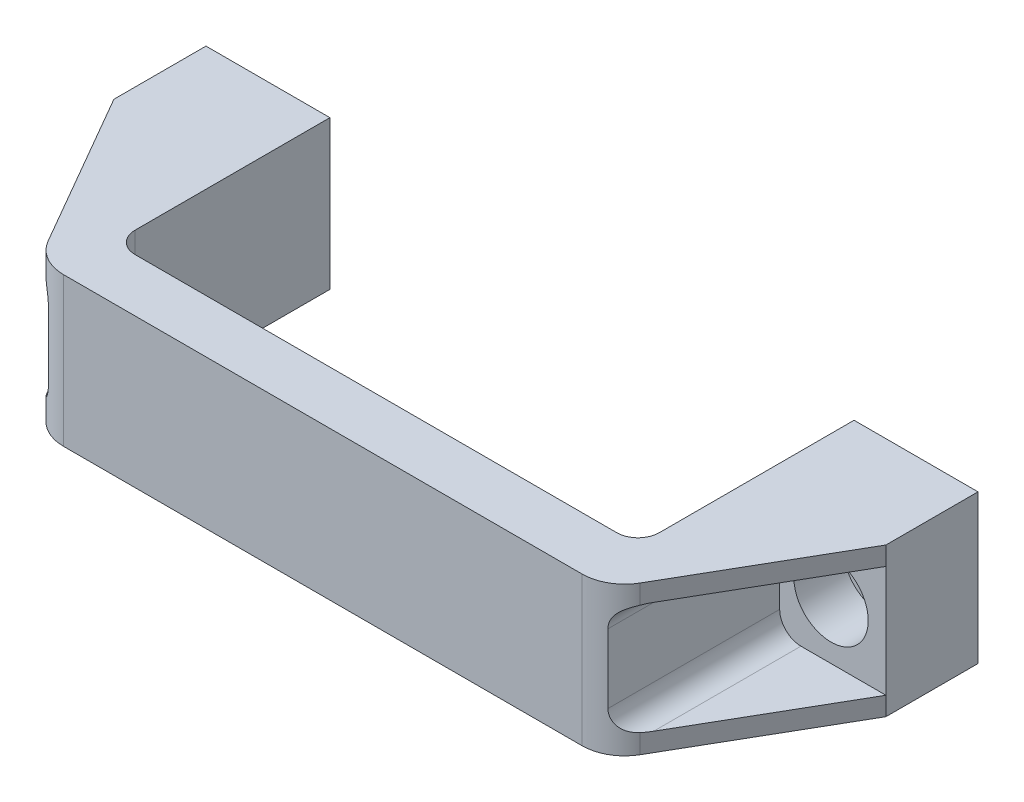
ISO-10303-21;
HEADER;
FILE_DESCRIPTION(('STEP AP214'),'2;1');
FILE_NAME('part.step','',(''),(''),'','','');
FILE_SCHEMA(('AUTOMOTIVE_DESIGN { 1 0 10303 214 1 1 1 1 }'));
ENDSEC;
DATA;
#1=APPLICATION_CONTEXT('core data for automotive mechanical design processes');
#2=APPLICATION_PROTOCOL_DEFINITION('international standard','automotive_design',2000,#1);
#3=PRODUCT_CONTEXT('',#1,'mechanical');
#4=PRODUCT('Part','Part','',(#3));
#5=PRODUCT_RELATED_PRODUCT_CATEGORY('part','',(#4));
#6=PRODUCT_DEFINITION_FORMATION('','',#4);
#7=PRODUCT_DEFINITION_CONTEXT('part definition',#1,'design');
#8=PRODUCT_DEFINITION('design','',#6,#7);
#9=PRODUCT_DEFINITION_SHAPE('','',#8);
#10=(LENGTH_UNIT() NAMED_UNIT(*) SI_UNIT(.MILLI.,.METRE.));
#11=(NAMED_UNIT(*) PLANE_ANGLE_UNIT() SI_UNIT($,.RADIAN.));
#12=(NAMED_UNIT(*) SI_UNIT($,.STERADIAN.) SOLID_ANGLE_UNIT());
#13=UNCERTAINTY_MEASURE_WITH_UNIT(LENGTH_MEASURE(1.E-05),#10,'distance_accuracy_value','');
#14=(GEOMETRIC_REPRESENTATION_CONTEXT(3) GLOBAL_UNCERTAINTY_ASSIGNED_CONTEXT((#13)) GLOBAL_UNIT_ASSIGNED_CONTEXT((#10,
#11,#12)) REPRESENTATION_CONTEXT('',''));
#15=CARTESIAN_POINT('',(0.,0.,0.));
#16=DIRECTION('',(0.,0.,1.));
#17=DIRECTION('',(1.,0.,0.));
#18=AXIS2_PLACEMENT_3D('',#15,#16,#17);
#19=CARTESIAN_POINT('',(0.,4.25,6.));
#20=DIRECTION('',(0.,0.,-1.));
#21=DIRECTION('',(0.,1.,0.));
#22=AXIS2_PLACEMENT_3D('',#19,#20,#21);
#23=PLANE('',#22);
#24=CARTESIAN_POINT('',(0.,0.,6.));
#25=DIRECTION('',(0.,0.,-1.));
#26=DIRECTION('',(0.,1.,0.));
#27=AXIS2_PLACEMENT_3D('',#24,#25,#26);
#28=CIRCLE('',#27,3.25);
#29=CARTESIAN_POINT('',(0.,3.25,6.));
#30=VERTEX_POINT('',#29);
#31=EDGE_CURVE('E194',#30,#30,#28,.T.);
#32=ORIENTED_EDGE('',*,*,#31,.T.);
#33=EDGE_LOOP('',(#32));
#34=FACE_BOUND('',#33,.T.);
#35=CARTESIAN_POINT('',(0.,0.,6.));
#36=DIRECTION('',(0.,0.,-1.));
#37=DIRECTION('',(0.,1.,0.));
#38=AXIS2_PLACEMENT_3D('',#35,#36,#37);
#39=CIRCLE('',#38,5.25);
#40=CARTESIAN_POINT('',(0.,5.25,6.));
#41=VERTEX_POINT('',#40);
#42=EDGE_CURVE('E17',#41,#41,#39,.F.);
#43=ORIENTED_EDGE('',*,*,#42,.T.);
#44=EDGE_LOOP('',(#43));
#45=FACE_BOUND('',#44,.T.);
#46=ADVANCED_FACE('F14',(#34,#45),#23,.F.);
#47=CARTESIAN_POINT('',(93.5,4.25,6.));
#48=DIRECTION('',(0.,0.,-1.));
#49=DIRECTION('',(0.,1.,0.));
#50=AXIS2_PLACEMENT_3D('',#47,#48,#49);
#51=PLANE('',#50);
#52=CARTESIAN_POINT('',(93.5,0.,6.));
#53=DIRECTION('',(0.,0.,-1.));
#54=DIRECTION('',(0.,1.,0.));
#55=AXIS2_PLACEMENT_3D('',#52,#53,#54);
#56=CIRCLE('',#55,3.25);
#57=CARTESIAN_POINT('',(93.5,3.25,6.));
#58=VERTEX_POINT('',#57);
#59=EDGE_CURVE('E191',#58,#58,#56,.T.);
#60=ORIENTED_EDGE('',*,*,#59,.T.);
#61=EDGE_LOOP('',(#60));
#62=FACE_BOUND('',#61,.T.);
#63=CARTESIAN_POINT('',(93.5,0.,6.));
#64=DIRECTION('',(0.,0.,-1.));
#65=DIRECTION('',(0.,1.,0.));
#66=AXIS2_PLACEMENT_3D('',#63,#64,#65);
#67=CIRCLE('',#66,5.25);
#68=CARTESIAN_POINT('',(93.5,5.25,6.));
#69=VERTEX_POINT('',#68);
#70=EDGE_CURVE('E196',#69,#69,#67,.F.);
#71=ORIENTED_EDGE('',*,*,#70,.T.);
#72=EDGE_LOOP('',(#71));
#73=FACE_BOUND('',#72,.T.);
#74=ADVANCED_FACE('F207',(#62,#73),#51,.F.);
#75=CARTESIAN_POINT('',(0.,0.,9.5));
#76=DIRECTION('',(0.,0.,-1.));
#77=DIRECTION('',(0.,1.,0.));
#78=AXIS2_PLACEMENT_3D('',#75,#76,#77);
#79=CYLINDRICAL_SURFACE('',#78,5.25);
#80=CARTESIAN_POINT('',(0.,0.,13.));
#81=DIRECTION('',(0.,0.,-1.));
#82=DIRECTION('',(0.,1.,0.));
#83=AXIS2_PLACEMENT_3D('',#80,#81,#82);
#84=CIRCLE('',#83,5.25);
#85=CARTESIAN_POINT('',(0.,5.25,13.));
#86=VERTEX_POINT('',#85);
#87=EDGE_CURVE('E171',#86,#86,#84,.T.);
#88=ORIENTED_EDGE('',*,*,#87,.F.);
#89=EDGE_LOOP('',(#88));
#90=FACE_BOUND('',#89,.T.);
#91=ORIENTED_EDGE('',*,*,#42,.F.);
#92=EDGE_LOOP('',(#91));
#93=FACE_BOUND('',#92,.T.);
#94=ADVANCED_FACE('F204',(#90,#93),#79,.F.);
#95=CARTESIAN_POINT('',(93.5,0.,9.5));
#96=DIRECTION('',(0.,0.,-1.));
#97=DIRECTION('',(0.,1.,0.));
#98=AXIS2_PLACEMENT_3D('',#95,#96,#97);
#99=CYLINDRICAL_SURFACE('',#98,5.25);
#100=CARTESIAN_POINT('',(93.5,0.,13.));
#101=DIRECTION('',(0.,0.,-1.));
#102=DIRECTION('',(0.,1.,0.));
#103=AXIS2_PLACEMENT_3D('',#100,#101,#102);
#104=CIRCLE('',#103,5.25);
#105=CARTESIAN_POINT('',(93.5,5.25,13.));
#106=VERTEX_POINT('',#105);
#107=EDGE_CURVE('E185',#106,#106,#104,.T.);
#108=ORIENTED_EDGE('',*,*,#107,.F.);
#109=EDGE_LOOP('',(#108));
#110=FACE_BOUND('',#109,.T.);
#111=ORIENTED_EDGE('',*,*,#70,.F.);
#112=EDGE_LOOP('',(#111));
#113=FACE_BOUND('',#112,.T.);
#114=ADVANCED_FACE('F206',(#110,#113),#99,.F.);
#115=CARTESIAN_POINT('',(-9.75,7.875,13.));
#116=DIRECTION('',(0.,1.,0.));
#117=DIRECTION('',(-1.,0.,0.));
#118=AXIS2_PLACEMENT_3D('',#115,#116,#117);
#119=PLANE('',#118);
#120=DIRECTION('',(1.,0.,0.));
#121=VECTOR('',#120,1.);
#122=CARTESIAN_POINT('',(46.75,7.875,13.));
#123=LINE('',#122,#121);
#124=CARTESIAN_POINT('',(4.25,7.875,13.));
#125=VERTEX_POINT('',#124);
#126=CARTESIAN_POINT('',(-7.75,7.875,13.));
#127=VERTEX_POINT('',#126);
#128=EDGE_CURVE('E170',#125,#127,#123,.F.);
#129=ORIENTED_EDGE('',*,*,#128,.F.);
#130=DIRECTION('',(0.,0.,-1.));
#131=VECTOR('',#130,1.);
#132=CARTESIAN_POINT('',(4.25,7.875,13.));
#133=LINE('',#132,#131);
#134=CARTESIAN_POINT('',(4.25,7.875,33.7846096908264));
#135=VERTEX_POINT('',#134);
#136=EDGE_CURVE('E385',#125,#135,#133,.F.);
#137=ORIENTED_EDGE('',*,*,#136,.T.);
#138=DIRECTION('',(-0.5,0.,-0.866025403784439));
#139=VECTOR('',#138,1.);
#140=CARTESIAN_POINT('',(4.9517059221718,7.875,35.));
#141=LINE('',#140,#139);
#142=EDGE_CURVE('E177',#127,#135,#141,.F.);
#143=ORIENTED_EDGE('',*,*,#142,.F.);
#144=EDGE_LOOP('',(#129,#137,#143));
#145=FACE_BOUND('',#144,.T.);
#146=ADVANCED_FACE('F215',(#145),#119,.F.);
#147=CARTESIAN_POINT('',(0.,0.,3.));
#148=DIRECTION('',(0.,0.,-1.));
#149=DIRECTION('',(0.,1.,0.));
#150=AXIS2_PLACEMENT_3D('',#147,#148,#149);
#151=CYLINDRICAL_SURFACE('',#150,3.25);
#152=CARTESIAN_POINT('',(0.,0.,0.));
#153=DIRECTION('',(0.,0.,-1.));
#154=DIRECTION('',(0.,1.,0.));
#155=AXIS2_PLACEMENT_3D('',#152,#153,#154);
#156=CIRCLE('',#155,3.25);
#157=CARTESIAN_POINT('',(0.,3.25,0.));
#158=VERTEX_POINT('',#157);
#159=EDGE_CURVE('E437',#158,#158,#156,.F.);
#160=ORIENTED_EDGE('',*,*,#159,.F.);
#161=EDGE_LOOP('',(#160));
#162=FACE_BOUND('',#161,.T.);
#163=ORIENTED_EDGE('',*,*,#31,.F.);
#164=EDGE_LOOP('',(#163));
#165=FACE_BOUND('',#164,.T.);
#166=ADVANCED_FACE('F374',(#162,#165),#151,.F.);
#167=CARTESIAN_POINT('',(93.5,0.,3.));
#168=DIRECTION('',(0.,0.,-1.));
#169=DIRECTION('',(0.,1.,0.));
#170=AXIS2_PLACEMENT_3D('',#167,#168,#169);
#171=CYLINDRICAL_SURFACE('',#170,3.25);
#172=CARTESIAN_POINT('',(93.5,0.,0.));
#173=DIRECTION('',(0.,0.,-1.));
#174=DIRECTION('',(0.,1.,0.));
#175=AXIS2_PLACEMENT_3D('',#172,#173,#174);
#176=CIRCLE('',#175,3.25);
#177=CARTESIAN_POINT('',(93.5,3.25,0.));
#178=VERTEX_POINT('',#177);
#179=EDGE_CURVE('E463',#178,#178,#176,.F.);
#180=ORIENTED_EDGE('',*,*,#179,.F.);
#181=EDGE_LOOP('',(#180));
#182=FACE_BOUND('',#181,.T.);
#183=ORIENTED_EDGE('',*,*,#59,.F.);
#184=EDGE_LOOP('',(#183));
#185=FACE_BOUND('',#184,.T.);
#186=ADVANCED_FACE('F371',(#182,#185),#171,.F.);
#187=CARTESIAN_POINT('',(4.25,-7.875,13.));
#188=DIRECTION('',(0.,-1.,0.));
#189=DIRECTION('',(1.,0.,0.));
#190=AXIS2_PLACEMENT_3D('',#187,#188,#189);
#191=PLANE('',#190);
#192=DIRECTION('',(0.,0.,-1.));
#193=VECTOR('',#192,1.);
#194=CARTESIAN_POINT('',(4.25,-7.875,13.));
#195=LINE('',#194,#193);
#196=CARTESIAN_POINT('',(4.25,-7.875,33.7846096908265));
#197=VERTEX_POINT('',#196);
#198=CARTESIAN_POINT('',(4.25,-7.875,13.));
#199=VERTEX_POINT('',#198);
#200=EDGE_CURVE('E147',#197,#199,#195,.T.);
#201=ORIENTED_EDGE('',*,*,#200,.T.);
#202=DIRECTION('',(1.,0.,0.));
#203=VECTOR('',#202,1.);
#204=CARTESIAN_POINT('',(46.75,-7.875,13.));
#205=LINE('',#204,#203);
#206=CARTESIAN_POINT('',(-7.75,-7.875,13.));
#207=VERTEX_POINT('',#206);
#208=EDGE_CURVE('E150',#207,#199,#205,.T.);
#209=ORIENTED_EDGE('',*,*,#208,.F.);
#210=DIRECTION('',(-0.5,0.,-0.866025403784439));
#211=VECTOR('',#210,1.);
#212=CARTESIAN_POINT('',(4.9517059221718,-7.875,35.));
#213=LINE('',#212,#211);
#214=EDGE_CURVE('E152',#197,#207,#213,.T.);
#215=ORIENTED_EDGE('',*,*,#214,.F.);
#216=EDGE_LOOP('',(#201,#209,#215));
#217=FACE_BOUND('',#216,.T.);
#218=ADVANCED_FACE('F149',(#217),#191,.F.);
#219=CARTESIAN_POINT('',(46.75,0.,13.));
#220=DIRECTION('',(0.,0.,1.));
#221=DIRECTION('',(0.,-1.,0.));
#222=AXIS2_PLACEMENT_3D('',#219,#220,#221);
#223=PLANE('',#222);
#224=CARTESIAN_POINT('',(4.25,4.875,13.));
#225=DIRECTION('',(0.,0.,-1.));
#226=DIRECTION('',(0.,1.,0.));
#227=AXIS2_PLACEMENT_3D('',#224,#225,#226);
#228=CIRCLE('',#227,3.);
#229=CARTESIAN_POINT('',(7.25,4.875,13.));
#230=VERTEX_POINT('',#229);
#231=EDGE_CURVE('E180',#230,#125,#228,.F.);
#232=ORIENTED_EDGE('',*,*,#231,.T.);
#233=ORIENTED_EDGE('',*,*,#128,.T.);
#234=DIRECTION('',(0.,-1.,0.));
#235=VECTOR('',#234,1.);
#236=CARTESIAN_POINT('',(-7.75,-10.5,13.));
#237=LINE('',#236,#235);
#238=EDGE_CURVE('E168',#207,#127,#237,.F.);
#239=ORIENTED_EDGE('',*,*,#238,.F.);
#240=ORIENTED_EDGE('',*,*,#208,.T.);
#241=CARTESIAN_POINT('',(4.25,-4.875,13.));
#242=DIRECTION('',(0.,0.,-1.));
#243=DIRECTION('',(0.,1.,0.));
#244=AXIS2_PLACEMENT_3D('',#241,#242,#243);
#245=CIRCLE('',#244,3.);
#246=CARTESIAN_POINT('',(7.25,-4.875,13.));
#247=VERTEX_POINT('',#246);
#248=EDGE_CURVE('E156',#199,#247,#245,.F.);
#249=ORIENTED_EDGE('',*,*,#248,.T.);
#250=DIRECTION('',(0.,1.,0.));
#251=VECTOR('',#250,1.);
#252=CARTESIAN_POINT('',(7.25,4.875,13.));
#253=LINE('',#252,#251);
#254=EDGE_CURVE('E389',#247,#230,#253,.T.);
#255=ORIENTED_EDGE('',*,*,#254,.T.);
#256=EDGE_LOOP('',(#232,#233,#239,#240,#249,#255));
#257=FACE_BOUND('',#256,.T.);
#258=ORIENTED_EDGE('',*,*,#87,.T.);
#259=EDGE_LOOP('',(#258));
#260=FACE_BOUND('',#259,.T.);
#261=ADVANCED_FACE('F163',(#257,#260),#223,.T.);
#262=CARTESIAN_POINT('',(89.25,7.875,13.));
#263=DIRECTION('',(0.,1.,0.));
#264=DIRECTION('',(-1.,0.,0.));
#265=AXIS2_PLACEMENT_3D('',#262,#263,#264);
#266=PLANE('',#265);
#267=DIRECTION('',(0.,0.,-1.));
#268=VECTOR('',#267,1.);
#269=CARTESIAN_POINT('',(89.25,7.875,13.));
#270=LINE('',#269,#268);
#271=CARTESIAN_POINT('',(89.25,7.875,33.7846096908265));
#272=VERTEX_POINT('',#271);
#273=CARTESIAN_POINT('',(89.25,7.875,13.));
#274=VERTEX_POINT('',#273);
#275=EDGE_CURVE('E408',#272,#274,#270,.T.);
#276=ORIENTED_EDGE('',*,*,#275,.T.);
#277=DIRECTION('',(1.,0.,0.));
#278=VECTOR('',#277,1.);
#279=CARTESIAN_POINT('',(46.75,7.875,13.));
#280=LINE('',#279,#278);
#281=CARTESIAN_POINT('',(101.25,7.875,13.));
#282=VERTEX_POINT('',#281);
#283=EDGE_CURVE('E188',#282,#274,#280,.F.);
#284=ORIENTED_EDGE('',*,*,#283,.F.);
#285=DIRECTION('',(-0.5,0.,0.866025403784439));
#286=VECTOR('',#285,1.);
#287=CARTESIAN_POINT('',(101.25,7.875,13.));
#288=LINE('',#287,#286);
#289=EDGE_CURVE('E413',#272,#282,#288,.F.);
#290=ORIENTED_EDGE('',*,*,#289,.F.);
#291=EDGE_LOOP('',(#276,#284,#290));
#292=FACE_BOUND('',#291,.T.);
#293=ADVANCED_FACE('F362',(#292),#266,.F.);
#294=CARTESIAN_POINT('',(103.25,-7.875,13.));
#295=DIRECTION('',(0.,-1.,0.));
#296=DIRECTION('',(1.,0.,0.));
#297=AXIS2_PLACEMENT_3D('',#294,#295,#296);
#298=PLANE('',#297);
#299=DIRECTION('',(1.,0.,0.));
#300=VECTOR('',#299,1.);
#301=CARTESIAN_POINT('',(46.75,-7.875,13.));
#302=LINE('',#301,#300);
#303=CARTESIAN_POINT('',(89.25,-7.875,13.));
#304=VERTEX_POINT('',#303);
#305=CARTESIAN_POINT('',(101.25,-7.875,13.));
#306=VERTEX_POINT('',#305);
#307=EDGE_CURVE('E157',#304,#306,#302,.T.);
#308=ORIENTED_EDGE('',*,*,#307,.F.);
#309=DIRECTION('',(0.,0.,-1.));
#310=VECTOR('',#309,1.);
#311=CARTESIAN_POINT('',(89.25,-7.875,13.));
#312=LINE('',#311,#310);
#313=CARTESIAN_POINT('',(89.25,-7.875,33.7846096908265));
#314=VERTEX_POINT('',#313);
#315=EDGE_CURVE('E492',#304,#314,#312,.F.);
#316=ORIENTED_EDGE('',*,*,#315,.T.);
#317=DIRECTION('',(-0.5,0.,0.866025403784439));
#318=VECTOR('',#317,1.);
#319=CARTESIAN_POINT('',(101.25,-7.875,13.));
#320=LINE('',#319,#318);
#321=EDGE_CURVE('E478',#306,#314,#320,.T.);
#322=ORIENTED_EDGE('',*,*,#321,.F.);
#323=EDGE_LOOP('',(#308,#316,#322));
#324=FACE_BOUND('',#323,.T.);
#325=ADVANCED_FACE('F358',(#324),#298,.F.);
#326=CARTESIAN_POINT('',(46.75,0.,13.));
#327=DIRECTION('',(0.,0.,1.));
#328=DIRECTION('',(0.,-1.,0.));
#329=AXIS2_PLACEMENT_3D('',#326,#327,#328);
#330=PLANE('',#329);
#331=CARTESIAN_POINT('',(89.25,-4.875,13.));
#332=DIRECTION('',(0.,0.,-1.));
#333=DIRECTION('',(0.,1.,0.));
#334=AXIS2_PLACEMENT_3D('',#331,#332,#333);
#335=CIRCLE('',#334,3.);
#336=CARTESIAN_POINT('',(86.25,-4.875,13.));
#337=VERTEX_POINT('',#336);
#338=EDGE_CURVE('E491',#337,#304,#335,.F.);
#339=ORIENTED_EDGE('',*,*,#338,.T.);
#340=ORIENTED_EDGE('',*,*,#307,.T.);
#341=DIRECTION('',(0.,1.,0.));
#342=VECTOR('',#341,1.);
#343=CARTESIAN_POINT('',(101.25,-10.5,13.));
#344=LINE('',#343,#342);
#345=EDGE_CURVE('E430',#282,#306,#344,.F.);
#346=ORIENTED_EDGE('',*,*,#345,.F.);
#347=ORIENTED_EDGE('',*,*,#283,.T.);
#348=CARTESIAN_POINT('',(89.25,4.875,13.));
#349=DIRECTION('',(0.,0.,-1.));
#350=DIRECTION('',(0.,1.,0.));
#351=AXIS2_PLACEMENT_3D('',#348,#349,#350);
#352=CIRCLE('',#351,3.);
#353=CARTESIAN_POINT('',(86.25,4.875,13.));
#354=VERTEX_POINT('',#353);
#355=EDGE_CURVE('E485',#274,#354,#352,.F.);
#356=ORIENTED_EDGE('',*,*,#355,.T.);
#357=DIRECTION('',(0.,-1.,0.));
#358=VECTOR('',#357,1.);
#359=CARTESIAN_POINT('',(86.25,-4.875,13.));
#360=LINE('',#359,#358);
#361=EDGE_CURVE('E422',#354,#337,#360,.T.);
#362=ORIENTED_EDGE('',*,*,#361,.T.);
#363=EDGE_LOOP('',(#339,#340,#346,#347,#356,#362));
#364=FACE_BOUND('',#363,.T.);
#365=ORIENTED_EDGE('',*,*,#107,.T.);
#366=EDGE_LOOP('',(#365));
#367=FACE_BOUND('',#366,.T.);
#368=ADVANCED_FACE('F355',(#364,#367),#330,.T.);
#369=CARTESIAN_POINT('',(4.25,-4.875,13.));
#370=DIRECTION('',(0.,0.,-1.));
#371=DIRECTION('',(0.,1.,0.));
#372=AXIS2_PLACEMENT_3D('',#369,#370,#371);
#373=CYLINDRICAL_SURFACE('',#372,3.);
#374=CARTESIAN_POINT('',(7.25,-4.875,37.2538002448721));
#375=CARTESIAN_POINT('',(7.25001127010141,-4.9491804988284,37.2537946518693));
#376=CARTESIAN_POINT('',(7.24724879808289,-5.02335775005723,37.252282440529));
#377=CARTESIAN_POINT('',(7.23626094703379,-5.17117698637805,37.2462055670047));
#378=CARTESIAN_POINT('',(7.2280358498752,-5.24481899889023,37.2416410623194));
#379=CARTESIAN_POINT('',(7.20622206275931,-5.39094791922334,37.2294286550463));
#380=CARTESIAN_POINT('',(7.19264063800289,-5.4634362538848,37.2217849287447));
#381=CARTESIAN_POINT('',(7.16030108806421,-5.60681870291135,37.2033493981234));
#382=CARTESIAN_POINT('',(7.14154304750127,-5.67771284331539,37.1925576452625));
#383=CARTESIAN_POINT('',(7.07780020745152,-5.88732853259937,37.1553082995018));
#384=CARTESIAN_POINT('',(7.02533947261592,-6.02303065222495,37.1239728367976));
#385=CARTESIAN_POINT('',(6.90334986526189,-6.28222511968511,37.0476033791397));
#386=CARTESIAN_POINT('',(6.83382422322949,-6.40571977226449,37.0025719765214));
#387=CARTESIAN_POINT('',(6.68121945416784,-6.63811343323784,36.8980579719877));
#388=CARTESIAN_POINT('',(6.59808305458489,-6.74694706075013,36.8385137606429));
#389=CARTESIAN_POINT('',(6.42317763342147,-6.94744158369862,36.7051904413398));
#390=CARTESIAN_POINT('',(6.33141129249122,-7.03910778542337,36.6314157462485));
#391=CARTESIAN_POINT('',(6.13886454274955,-7.20944294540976,36.4659750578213));
#392=CARTESIAN_POINT('',(6.03786599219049,-7.28711893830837,36.3735478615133));
#393=CARTESIAN_POINT('',(5.83636886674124,-7.42418526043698,36.1750569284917));
#394=CARTESIAN_POINT('',(5.73587228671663,-7.4835273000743,36.0689582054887));
#395=CARTESIAN_POINT('',(5.57473077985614,-7.56761078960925,35.8853174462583));
#396=CARTESIAN_POINT('',(5.51267542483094,-7.5971395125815,35.8111153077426));
#397=CARTESIAN_POINT('',(5.391242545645,-7.65023971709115,35.6584306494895));
#398=CARTESIAN_POINT('',(5.331866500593,-7.6738079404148,35.5799458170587));
#399=CARTESIAN_POINT('',(5.2167914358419,-7.71560698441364,35.4196860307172));
#400=CARTESIAN_POINT('',(5.16107364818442,-7.73386702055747,35.3379320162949));
#401=CARTESIAN_POINT('',(5.05344907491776,-7.7659514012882,35.171255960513));
#402=CARTESIAN_POINT('',(5.00153757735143,-7.77978130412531,35.0863380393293));
#403=CARTESIAN_POINT('',(4.95170592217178,-7.79178055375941,35.));
#404=B_SPLINE_CURVE_WITH_KNOTS('',3,(#374,#375,#376,#377,#378,#379,#380,#381,#382,#383,#384,
#385,#386,#387,#388,#389,#390,#391,#392,#393,#394,#395,#396,#397,#398,#399,#400,#401,#402,#403),
.UNSPECIFIED.,.F.,.F.,(4,2,2,2,2,2,2,2,2,2,2,2,2,2,4),(0.,0.222468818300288,0.444926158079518,
0.667082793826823,0.889235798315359,1.33339963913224,1.77747946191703,2.22347836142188,
2.66933917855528,3.13973830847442,3.61136605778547,3.91449827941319,4.21779584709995,
4.51939105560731,4.82060637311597),.UNSPECIFIED.);
#405=CARTESIAN_POINT('',(7.25,-4.875,37.2538002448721));
#406=VERTEX_POINT('',#405);
#407=CARTESIAN_POINT('',(4.95170592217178,-7.79178055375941,35.));
#408=VERTEX_POINT('',#407);
#409=EDGE_CURVE('E341',#406,#408,#404,.T.);
#410=ORIENTED_EDGE('',*,*,#409,.F.);
#411=DIRECTION('',(0.,0.,1.));
#412=VECTOR('',#411,1.);
#413=CARTESIAN_POINT('',(7.25,-4.875,13.));
#414=LINE('',#413,#412);
#415=EDGE_CURVE('E175',#406,#247,#414,.F.);
#416=ORIENTED_EDGE('',*,*,#415,.T.);
#417=ORIENTED_EDGE('',*,*,#248,.F.);
#418=ORIENTED_EDGE('',*,*,#200,.F.);
#419=CARTESIAN_POINT('',(4.25,-4.875,33.7846096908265));
#420=DIRECTION('',(-0.866025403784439,0.,0.5));
#421=DIRECTION('',(-0.5,0.,-0.866025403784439));
#422=AXIS2_PLACEMENT_3D('',#419,#420,#421);
#423=ELLIPSE('',#422,6.,3.);
#424=EDGE_CURVE('E446',#408,#197,#423,.F.);
#425=ORIENTED_EDGE('',*,*,#424,.F.);
#426=EDGE_LOOP('',(#410,#416,#417,#418,#425));
#427=FACE_BOUND('',#426,.T.);
#428=ADVANCED_FACE('F173',(#427),#373,.F.);
#429=CARTESIAN_POINT('',(4.9517059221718,-10.5,35.));
#430=DIRECTION('',(-0.866025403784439,0.,0.5));
#431=DIRECTION('',(-0.5,0.,-0.866025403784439));
#432=AXIS2_PLACEMENT_3D('',#429,#430,#431);
#433=PLANE('',#432);
#434=DIRECTION('',(-0.5,0.,-0.866025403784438));
#435=VECTOR('',#434,1.);
#436=CARTESIAN_POINT('',(4.9517059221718,10.5,35.));
#437=LINE('',#436,#435);
#438=CARTESIAN_POINT('',(4.95170592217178,10.5,35.));
#439=VERTEX_POINT('',#438);
#440=CARTESIAN_POINT('',(-7.75,10.5,13.));
#441=VERTEX_POINT('',#440);
#442=EDGE_CURVE('E404',#439,#441,#437,.T.);
#443=ORIENTED_EDGE('',*,*,#442,.T.);
#444=DIRECTION('',(0.,-1.,0.));
#445=VECTOR('',#444,1.);
#446=CARTESIAN_POINT('',(-7.75,-10.5,13.));
#447=LINE('',#446,#445);
#448=EDGE_CURVE('E405',#127,#441,#447,.F.);
#449=ORIENTED_EDGE('',*,*,#448,.F.);
#450=ORIENTED_EDGE('',*,*,#142,.T.);
#451=CARTESIAN_POINT('',(4.25,4.875,33.7846096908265));
#452=DIRECTION('',(-0.866025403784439,0.,0.5));
#453=DIRECTION('',(-0.5,0.,-0.866025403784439));
#454=AXIS2_PLACEMENT_3D('',#451,#452,#453);
#455=ELLIPSE('',#454,6.,3.);
#456=CARTESIAN_POINT('',(4.95170592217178,7.7917805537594,35.));
#457=VERTEX_POINT('',#456);
#458=EDGE_CURVE('E393',#135,#457,#455,.F.);
#459=ORIENTED_EDGE('',*,*,#458,.T.);
#460=DIRECTION('',(0.,-1.,0.));
#461=VECTOR('',#460,1.);
#462=CARTESIAN_POINT('',(4.95170592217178,-10.5,35.));
#463=LINE('',#462,#461);
#464=EDGE_CURVE('E329',#439,#457,#463,.T.);
#465=ORIENTED_EDGE('',*,*,#464,.F.);
#466=EDGE_LOOP('',(#443,#449,#450,#459,#465));
#467=FACE_BOUND('',#466,.T.);
#468=ADVANCED_FACE('F316',(#467),#433,.T.);
#469=CARTESIAN_POINT('',(4.25,4.875,13.));
#470=DIRECTION('',(0.,0.,-1.));
#471=DIRECTION('',(0.,1.,0.));
#472=AXIS2_PLACEMENT_3D('',#469,#470,#471);
#473=CYLINDRICAL_SURFACE('',#472,3.);
#474=ORIENTED_EDGE('',*,*,#136,.F.);
#475=ORIENTED_EDGE('',*,*,#231,.F.);
#476=DIRECTION('',(0.,0.,1.));
#477=VECTOR('',#476,1.);
#478=CARTESIAN_POINT('',(7.25,4.875,13.));
#479=LINE('',#478,#477);
#480=CARTESIAN_POINT('',(7.25,4.875,37.2538002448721));
#481=VERTEX_POINT('',#480);
#482=EDGE_CURVE('E436',#230,#481,#479,.T.);
#483=ORIENTED_EDGE('',*,*,#482,.T.);
#484=CARTESIAN_POINT('',(4.95170592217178,7.7917805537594,35.));
#485=CARTESIAN_POINT('',(5.0147180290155,7.7765943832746,35.1092163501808));
#486=CARTESIAN_POINT('',(5.08110328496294,7.75848641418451,35.2161747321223));
#487=CARTESIAN_POINT('',(5.21986651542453,7.71484374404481,35.4249873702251));
#488=CARTESIAN_POINT('',(5.29226123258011,7.68928775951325,35.5268260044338));
#489=CARTESIAN_POINT('',(5.44243393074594,7.62902774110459,35.7248543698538));
#490=CARTESIAN_POINT('',(5.52024575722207,7.59426150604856,35.8210000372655));
#491=CARTESIAN_POINT('',(5.67914273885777,7.51421791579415,36.0056731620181));
#492=CARTESIAN_POINT('',(5.76022320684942,7.46895519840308,36.0942109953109));
#493=CARTESIAN_POINT('',(5.94888134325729,7.3508065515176,36.288587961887));
#494=CARTESIAN_POINT('',(6.056992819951,7.27370610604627,36.3914592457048));
#495=CARTESIAN_POINT('',(6.21633140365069,7.14178143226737,36.5330111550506));
#496=CARTESIAN_POINT('',(6.26889910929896,7.09517302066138,36.5780135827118));
#497=CARTESIAN_POINT('',(6.37236418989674,6.9964785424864,36.663703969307));
#498=CARTESIAN_POINT('',(6.42326231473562,6.94439498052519,36.7043938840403));
#499=CARTESIAN_POINT('',(6.52291862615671,6.83443553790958,36.7816128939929));
#500=CARTESIAN_POINT('',(6.5716584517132,6.7765201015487,36.8181094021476));
#501=CARTESIAN_POINT('',(6.66572396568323,6.65549128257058,36.8865244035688));
#502=CARTESIAN_POINT('',(6.71105111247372,6.59238014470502,36.9184448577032));
#503=CARTESIAN_POINT('',(6.79756595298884,6.46121715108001,36.97778062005));
#504=CARTESIAN_POINT('',(6.83874735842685,6.39315805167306,37.0051891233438));
#505=CARTESIAN_POINT('',(6.91614264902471,6.25272368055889,37.0555059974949));
#506=CARTESIAN_POINT('',(6.95235707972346,6.18034888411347,37.0784148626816));
#507=CARTESIAN_POINT('',(7.04641603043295,5.9712836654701,37.1367484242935));
#508=CARTESIAN_POINT('',(7.09786086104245,5.83021141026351,37.1671743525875));
#509=CARTESIAN_POINT('',(7.17922867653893,5.54004675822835,37.2143538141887));
#510=CARTESIAN_POINT('',(7.20918703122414,5.39096797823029,37.2311298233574));
#511=CARTESIAN_POINT('',(7.23511593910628,5.1796743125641,37.2455676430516));
#512=CARTESIAN_POINT('',(7.24069731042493,5.1188585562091,37.2486602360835));
#513=CARTESIAN_POINT('',(7.24813564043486,4.99703749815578,37.2527730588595));
#514=CARTESIAN_POINT('',(7.24999914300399,4.93603271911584,37.2537969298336));
#515=CARTESIAN_POINT('',(7.25,4.875,37.2538002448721));
#516=B_SPLINE_CURVE_WITH_KNOTS('',3,(#484,#485,#486,#487,#488,#489,#490,#491,#492,#493,#494,
#495,#496,#497,#498,#499,#500,#501,#502,#503,#504,#505,#506,#507,#508,#509,#510,#511,#512,#513,
#514,#515),.UNSPECIFIED.,.F.,.F.,(4,2,2,2,2,2,2,2,2,2,2,2,2,2,2,4),(0.,0.381029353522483,
0.763158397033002,1.14793700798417,1.53218222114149,2.03371129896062,2.28375630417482,
2.53368741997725,2.785445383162,3.03709514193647,3.2891210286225,3.54111921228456,
3.99831846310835,4.45476336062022,4.63809171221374,4.82109709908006),.UNSPECIFIED.);
#517=EDGE_CURVE('E320',#457,#481,#516,.T.);
#518=ORIENTED_EDGE('',*,*,#517,.F.);
#519=ORIENTED_EDGE('',*,*,#458,.F.);
#520=EDGE_LOOP('',(#474,#475,#483,#518,#519));
#521=FACE_BOUND('',#520,.T.);
#522=ADVANCED_FACE('F311',(#521),#473,.F.);
#523=CARTESIAN_POINT('',(7.25,4.875,13.));
#524=DIRECTION('',(1.,0.,0.));
#525=DIRECTION('',(0.,1.,0.));
#526=AXIS2_PLACEMENT_3D('',#523,#524,#525);
#527=PLANE('',#526);
#528=ORIENTED_EDGE('',*,*,#482,.F.);
#529=ORIENTED_EDGE('',*,*,#254,.F.);
#530=ORIENTED_EDGE('',*,*,#415,.F.);
#531=DIRECTION('',(0.,-1.,0.));
#532=VECTOR('',#531,1.);
#533=CARTESIAN_POINT('',(7.25,-10.5,37.2538002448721));
#534=LINE('',#533,#532);
#535=EDGE_CURVE('E328',#481,#406,#534,.T.);
#536=ORIENTED_EDGE('',*,*,#535,.F.);
#537=EDGE_LOOP('',(#528,#529,#530,#536));
#538=FACE_BOUND('',#537,.T.);
#539=ADVANCED_FACE('F307',(#538),#527,.F.);
#540=CARTESIAN_POINT('',(-7.75,-10.5,0.));
#541=DIRECTION('',(0.,0.,-1.));
#542=DIRECTION('',(0.,1.,0.));
#543=AXIS2_PLACEMENT_3D('',#540,#541,#542);
#544=PLANE('',#543);
#545=DIRECTION('',(1.,0.,0.));
#546=VECTOR('',#545,1.);
#547=CARTESIAN_POINT('',(46.75,-10.5,0.));
#548=LINE('',#547,#546);
#549=CARTESIAN_POINT('',(-7.75,-10.5,0.));
#550=VERTEX_POINT('',#549);
#551=CARTESIAN_POINT('',(9.75,-10.5,0.));
#552=VERTEX_POINT('',#551);
#553=EDGE_CURVE('E447',#550,#552,#548,.T.);
#554=ORIENTED_EDGE('',*,*,#553,.F.);
#555=DIRECTION('',(0.,-1.,0.));
#556=VECTOR('',#555,1.);
#557=CARTESIAN_POINT('',(-7.75,-10.5,0.));
#558=LINE('',#557,#556);
#559=CARTESIAN_POINT('',(-7.75,10.5,0.));
#560=VERTEX_POINT('',#559);
#561=EDGE_CURVE('E443',#560,#550,#558,.T.);
#562=ORIENTED_EDGE('',*,*,#561,.F.);
#563=DIRECTION('',(1.,0.,0.));
#564=VECTOR('',#563,1.);
#565=CARTESIAN_POINT('',(46.75,10.5,0.));
#566=LINE('',#565,#564);
#567=CARTESIAN_POINT('',(9.75,10.5,0.));
#568=VERTEX_POINT('',#567);
#569=EDGE_CURVE('E398',#560,#568,#566,.T.);
#570=ORIENTED_EDGE('',*,*,#569,.T.);
#571=DIRECTION('',(0.,1.,0.));
#572=VECTOR('',#571,1.);
#573=CARTESIAN_POINT('',(9.75,-10.5,0.));
#574=LINE('',#573,#572);
#575=EDGE_CURVE('E440',#552,#568,#574,.T.);
#576=ORIENTED_EDGE('',*,*,#575,.F.);
#577=EDGE_LOOP('',(#554,#562,#570,#576));
#578=FACE_BOUND('',#577,.T.);
#579=ORIENTED_EDGE('',*,*,#159,.T.);
#580=EDGE_LOOP('',(#579));
#581=FACE_BOUND('',#580,.T.);
#582=ADVANCED_FACE('F303',(#578,#581),#544,.T.);
#583=CARTESIAN_POINT('',(9.75,-10.5,0.));
#584=DIRECTION('',(1.,0.,0.));
#585=DIRECTION('',(0.,1.,0.));
#586=AXIS2_PLACEMENT_3D('',#583,#584,#585);
#587=PLANE('',#586);
#588=DIRECTION('',(0.,0.,1.));
#589=VECTOR('',#588,1.);
#590=CARTESIAN_POINT('',(9.75,-10.5,0.));
#591=LINE('',#590,#589);
#592=CARTESIAN_POINT('',(9.75,-10.5,27.5));
#593=VERTEX_POINT('',#592);
#594=EDGE_CURVE('E450',#552,#593,#591,.T.);
#595=ORIENTED_EDGE('',*,*,#594,.F.);
#596=ORIENTED_EDGE('',*,*,#575,.T.);
#597=DIRECTION('',(0.,0.,1.));
#598=VECTOR('',#597,1.);
#599=CARTESIAN_POINT('',(9.75,10.5,0.));
#600=LINE('',#599,#598);
#601=CARTESIAN_POINT('',(9.75,10.5,27.5));
#602=VERTEX_POINT('',#601);
#603=EDGE_CURVE('E349',#568,#602,#600,.T.);
#604=ORIENTED_EDGE('',*,*,#603,.T.);
#605=DIRECTION('',(0.,-1.,0.));
#606=VECTOR('',#605,1.);
#607=CARTESIAN_POINT('',(9.75,-10.5,27.5));
#608=LINE('',#607,#606);
#609=EDGE_CURVE('E453',#602,#593,#608,.T.);
#610=ORIENTED_EDGE('',*,*,#609,.T.);
#611=EDGE_LOOP('',(#595,#596,#604,#610));
#612=FACE_BOUND('',#611,.T.);
#613=ADVANCED_FACE('F299',(#612),#587,.T.);
#614=CARTESIAN_POINT('',(12.75,-10.5,27.5));
#615=DIRECTION('',(0.,-1.,0.));
#616=DIRECTION('',(1.,0.,0.));
#617=AXIS2_PLACEMENT_3D('',#614,#615,#616);
#618=CYLINDRICAL_SURFACE('',#617,3.);
#619=DIRECTION('',(0.,1.,0.));
#620=VECTOR('',#619,1.);
#621=CARTESIAN_POINT('',(12.75,-10.5,30.5));
#622=LINE('',#621,#620);
#623=CARTESIAN_POINT('',(12.75,-10.5,30.5));
#624=VERTEX_POINT('',#623);
#625=CARTESIAN_POINT('',(12.75,10.5,30.5));
#626=VERTEX_POINT('',#625);
#627=EDGE_CURVE('E455',#624,#626,#622,.T.);
#628=ORIENTED_EDGE('',*,*,#627,.F.);
#629=CARTESIAN_POINT('',(12.75,-10.5,27.5));
#630=DIRECTION('',(0.,-1.,0.));
#631=DIRECTION('',(1.,0.,0.));
#632=AXIS2_PLACEMENT_3D('',#629,#630,#631);
#633=CIRCLE('',#632,3.);
#634=EDGE_CURVE('E330',#593,#624,#633,.F.);
#635=ORIENTED_EDGE('',*,*,#634,.F.);
#636=ORIENTED_EDGE('',*,*,#609,.F.);
#637=CARTESIAN_POINT('',(12.75,10.5,27.5));
#638=DIRECTION('',(0.,-1.,0.));
#639=DIRECTION('',(1.,0.,0.));
#640=AXIS2_PLACEMENT_3D('',#637,#638,#639);
#641=CIRCLE('',#640,3.);
#642=EDGE_CURVE('E499',#602,#626,#641,.F.);
#643=ORIENTED_EDGE('',*,*,#642,.T.);
#644=EDGE_LOOP('',(#628,#635,#636,#643));
#645=FACE_BOUND('',#644,.T.);
#646=ADVANCED_FACE('F295',(#645),#618,.F.);
#647=CARTESIAN_POINT('',(12.75,-10.5,30.5));
#648=DIRECTION('',(0.,0.,-1.));
#649=DIRECTION('',(0.,1.,0.));
#650=AXIS2_PLACEMENT_3D('',#647,#648,#649);
#651=PLANE('',#650);
#652=DIRECTION('',(1.,0.,0.));
#653=VECTOR('',#652,1.);
#654=CARTESIAN_POINT('',(46.75,-10.5,30.5));
#655=LINE('',#654,#653);
#656=CARTESIAN_POINT('',(80.75,-10.5,30.5));
#657=VERTEX_POINT('',#656);
#658=EDGE_CURVE('E524',#624,#657,#655,.T.);
#659=ORIENTED_EDGE('',*,*,#658,.F.);
#660=ORIENTED_EDGE('',*,*,#627,.T.);
#661=DIRECTION('',(1.,0.,0.));
#662=VECTOR('',#661,1.);
#663=CARTESIAN_POINT('',(46.75,10.5,30.5));
#664=LINE('',#663,#662);
#665=CARTESIAN_POINT('',(80.75,10.5,30.5));
#666=VERTEX_POINT('',#665);
#667=EDGE_CURVE('E500',#626,#666,#664,.T.);
#668=ORIENTED_EDGE('',*,*,#667,.T.);
#669=DIRECTION('',(0.,-1.,0.));
#670=VECTOR('',#669,1.);
#671=CARTESIAN_POINT('',(80.75,-10.5,30.5));
#672=LINE('',#671,#670);
#673=EDGE_CURVE('E458',#666,#657,#672,.T.);
#674=ORIENTED_EDGE('',*,*,#673,.T.);
#675=EDGE_LOOP('',(#659,#660,#668,#674));
#676=FACE_BOUND('',#675,.T.);
#677=ADVANCED_FACE('F291',(#676),#651,.T.);
#678=CARTESIAN_POINT('',(80.75,-10.5,27.5));
#679=DIRECTION('',(0.,-1.,0.));
#680=DIRECTION('',(1.,0.,0.));
#681=AXIS2_PLACEMENT_3D('',#678,#679,#680);
#682=CYLINDRICAL_SURFACE('',#681,3.);
#683=DIRECTION('',(0.,-1.,0.));
#684=VECTOR('',#683,1.);
#685=CARTESIAN_POINT('',(83.75,-10.5,27.5));
#686=LINE('',#685,#684);
#687=CARTESIAN_POINT('',(83.75,-10.5,27.5));
#688=VERTEX_POINT('',#687);
#689=CARTESIAN_POINT('',(83.75,10.5,27.5));
#690=VERTEX_POINT('',#689);
#691=EDGE_CURVE('E460',#688,#690,#686,.F.);
#692=ORIENTED_EDGE('',*,*,#691,.F.);
#693=CARTESIAN_POINT('',(80.75,-10.5,27.5));
#694=DIRECTION('',(0.,-1.,0.));
#695=DIRECTION('',(1.,0.,0.));
#696=AXIS2_PLACEMENT_3D('',#693,#694,#695);
#697=CIRCLE('',#696,3.);
#698=EDGE_CURVE('E527',#657,#688,#697,.F.);
#699=ORIENTED_EDGE('',*,*,#698,.F.);
#700=ORIENTED_EDGE('',*,*,#673,.F.);
#701=CARTESIAN_POINT('',(80.75,10.5,27.5));
#702=DIRECTION('',(0.,-1.,0.));
#703=DIRECTION('',(1.,0.,0.));
#704=AXIS2_PLACEMENT_3D('',#701,#702,#703);
#705=CIRCLE('',#704,3.);
#706=EDGE_CURVE('E350',#666,#690,#705,.F.);
#707=ORIENTED_EDGE('',*,*,#706,.T.);
#708=EDGE_LOOP('',(#692,#699,#700,#707));
#709=FACE_BOUND('',#708,.T.);
#710=ADVANCED_FACE('F287',(#709),#682,.F.);
#711=CARTESIAN_POINT('',(83.75,-10.5,27.5));
#712=DIRECTION('',(-1.,0.,0.));
#713=DIRECTION('',(0.,-1.,0.));
#714=AXIS2_PLACEMENT_3D('',#711,#712,#713);
#715=PLANE('',#714);
#716=DIRECTION('',(0.,0.,1.));
#717=VECTOR('',#716,1.);
#718=CARTESIAN_POINT('',(83.75,-10.5,0.));
#719=LINE('',#718,#717);
#720=CARTESIAN_POINT('',(83.75,-10.5,0.));
#721=VERTEX_POINT('',#720);
#722=EDGE_CURVE('E470',#688,#721,#719,.F.);
#723=ORIENTED_EDGE('',*,*,#722,.F.);
#724=ORIENTED_EDGE('',*,*,#691,.T.);
#725=DIRECTION('',(0.,0.,1.));
#726=VECTOR('',#725,1.);
#727=CARTESIAN_POINT('',(83.75,10.5,0.));
#728=LINE('',#727,#726);
#729=CARTESIAN_POINT('',(83.75,10.5,0.));
#730=VERTEX_POINT('',#729);
#731=EDGE_CURVE('E421',#690,#730,#728,.F.);
#732=ORIENTED_EDGE('',*,*,#731,.T.);
#733=DIRECTION('',(0.,1.,0.));
#734=VECTOR('',#733,1.);
#735=CARTESIAN_POINT('',(83.75,-10.5,0.));
#736=LINE('',#735,#734);
#737=EDGE_CURVE('E434',#721,#730,#736,.T.);
#738=ORIENTED_EDGE('',*,*,#737,.F.);
#739=EDGE_LOOP('',(#723,#724,#732,#738));
#740=FACE_BOUND('',#739,.T.);
#741=ADVANCED_FACE('F283',(#740),#715,.T.);
#742=CARTESIAN_POINT('',(83.75,-10.5,0.));
#743=DIRECTION('',(0.,0.,-1.));
#744=DIRECTION('',(0.,1.,0.));
#745=AXIS2_PLACEMENT_3D('',#742,#743,#744);
#746=PLANE('',#745);
#747=DIRECTION('',(1.,0.,0.));
#748=VECTOR('',#747,1.);
#749=CARTESIAN_POINT('',(46.75,-10.5,0.));
#750=LINE('',#749,#748);
#751=CARTESIAN_POINT('',(101.25,-10.5,0.));
#752=VERTEX_POINT('',#751);
#753=EDGE_CURVE('E466',#721,#752,#750,.T.);
#754=ORIENTED_EDGE('',*,*,#753,.F.);
#755=ORIENTED_EDGE('',*,*,#737,.T.);
#756=DIRECTION('',(1.,0.,0.));
#757=VECTOR('',#756,1.);
#758=CARTESIAN_POINT('',(46.75,10.5,0.));
#759=LINE('',#758,#757);
#760=CARTESIAN_POINT('',(101.25,10.5,0.));
#761=VERTEX_POINT('',#760);
#762=EDGE_CURVE('E418',#730,#761,#759,.T.);
#763=ORIENTED_EDGE('',*,*,#762,.T.);
#764=DIRECTION('',(0.,1.,0.));
#765=VECTOR('',#764,1.);
#766=CARTESIAN_POINT('',(101.25,-10.5,0.));
#767=LINE('',#766,#765);
#768=EDGE_CURVE('E433',#752,#761,#767,.T.);
#769=ORIENTED_EDGE('',*,*,#768,.F.);
#770=EDGE_LOOP('',(#754,#755,#763,#769));
#771=FACE_BOUND('',#770,.T.);
#772=ORIENTED_EDGE('',*,*,#179,.T.);
#773=EDGE_LOOP('',(#772));
#774=FACE_BOUND('',#773,.T.);
#775=ADVANCED_FACE('F279',(#771,#774),#746,.T.);
#776=CARTESIAN_POINT('',(101.25,-10.5,0.));
#777=DIRECTION('',(1.,0.,0.));
#778=DIRECTION('',(0.,1.,0.));
#779=AXIS2_PLACEMENT_3D('',#776,#777,#778);
#780=PLANE('',#779);
#781=DIRECTION('',(0.,0.,1.));
#782=VECTOR('',#781,1.);
#783=CARTESIAN_POINT('',(101.25,-10.5,0.));
#784=LINE('',#783,#782);
#785=CARTESIAN_POINT('',(101.25,-10.5,13.));
#786=VERTEX_POINT('',#785);
#787=EDGE_CURVE('E469',#752,#786,#784,.T.);
#788=ORIENTED_EDGE('',*,*,#787,.F.);
#789=ORIENTED_EDGE('',*,*,#768,.T.);
#790=DIRECTION('',(0.,0.,1.));
#791=VECTOR('',#790,1.);
#792=CARTESIAN_POINT('',(101.25,10.5,0.));
#793=LINE('',#792,#791);
#794=CARTESIAN_POINT('',(101.25,10.5,13.));
#795=VERTEX_POINT('',#794);
#796=EDGE_CURVE('E414',#761,#795,#793,.T.);
#797=ORIENTED_EDGE('',*,*,#796,.T.);
#798=DIRECTION('',(0.,-1.,0.));
#799=VECTOR('',#798,1.);
#800=CARTESIAN_POINT('',(101.25,-10.5,13.));
#801=LINE('',#800,#799);
#802=EDGE_CURVE('E409',#282,#795,#801,.F.);
#803=ORIENTED_EDGE('',*,*,#802,.F.);
#804=ORIENTED_EDGE('',*,*,#345,.T.);
#805=DIRECTION('',(0.,-1.,0.));
#806=VECTOR('',#805,1.);
#807=CARTESIAN_POINT('',(101.25,-10.5,13.));
#808=LINE('',#807,#806);
#809=EDGE_CURVE('E412',#786,#306,#808,.F.);
#810=ORIENTED_EDGE('',*,*,#809,.F.);
#811=EDGE_LOOP('',(#788,#789,#797,#803,#804,#810));
#812=FACE_BOUND('',#811,.T.);
#813=ADVANCED_FACE('F275',(#812),#780,.T.);
#814=CARTESIAN_POINT('',(4.9517059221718,-10.5,35.));
#815=DIRECTION('',(-0.866025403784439,0.,0.5));
#816=DIRECTION('',(-0.5,0.,-0.866025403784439));
#817=AXIS2_PLACEMENT_3D('',#814,#815,#816);
#818=PLANE('',#817);
#819=DIRECTION('',(0.,-1.,0.));
#820=VECTOR('',#819,1.);
#821=CARTESIAN_POINT('',(4.95170592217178,-10.5,35.));
#822=LINE('',#821,#820);
#823=CARTESIAN_POINT('',(4.95170592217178,-10.5,35.));
#824=VERTEX_POINT('',#823);
#825=EDGE_CURVE('E348',#408,#824,#822,.T.);
#826=ORIENTED_EDGE('',*,*,#825,.F.);
#827=ORIENTED_EDGE('',*,*,#424,.T.);
#828=ORIENTED_EDGE('',*,*,#214,.T.);
#829=DIRECTION('',(0.,-1.,0.));
#830=VECTOR('',#829,1.);
#831=CARTESIAN_POINT('',(-7.75,-10.5,13.));
#832=LINE('',#831,#830);
#833=CARTESIAN_POINT('',(-7.75,-10.5,13.));
#834=VERTEX_POINT('',#833);
#835=EDGE_CURVE('E435',#834,#207,#832,.F.);
#836=ORIENTED_EDGE('',*,*,#835,.F.);
#837=DIRECTION('',(-0.5,0.,-0.866025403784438));
#838=VECTOR('',#837,1.);
#839=CARTESIAN_POINT('',(4.9517059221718,-10.5,35.));
#840=LINE('',#839,#838);
#841=EDGE_CURVE('E482',#824,#834,#840,.T.);
#842=ORIENTED_EDGE('',*,*,#841,.F.);
#843=EDGE_LOOP('',(#826,#827,#828,#836,#842));
#844=FACE_BOUND('',#843,.T.);
#845=ADVANCED_FACE('F271',(#844),#818,.T.);
#846=CARTESIAN_POINT('',(-7.75,-10.5,13.));
#847=DIRECTION('',(-1.,0.,0.));
#848=DIRECTION('',(0.,-1.,0.));
#849=AXIS2_PLACEMENT_3D('',#846,#847,#848);
#850=PLANE('',#849);
#851=ORIENTED_EDGE('',*,*,#238,.T.);
#852=ORIENTED_EDGE('',*,*,#448,.T.);
#853=DIRECTION('',(0.,0.,1.));
#854=VECTOR('',#853,1.);
#855=CARTESIAN_POINT('',(-7.75,10.5,0.));
#856=LINE('',#855,#854);
#857=EDGE_CURVE('E401',#441,#560,#856,.F.);
#858=ORIENTED_EDGE('',*,*,#857,.T.);
#859=ORIENTED_EDGE('',*,*,#561,.T.);
#860=DIRECTION('',(0.,0.,1.));
#861=VECTOR('',#860,1.);
#862=CARTESIAN_POINT('',(-7.75,-10.5,0.));
#863=LINE('',#862,#861);
#864=EDGE_CURVE('E256',#834,#550,#863,.F.);
#865=ORIENTED_EDGE('',*,*,#864,.F.);
#866=ORIENTED_EDGE('',*,*,#835,.T.);
#867=EDGE_LOOP('',(#851,#852,#858,#859,#865,#866));
#868=FACE_BOUND('',#867,.T.);
#869=ADVANCED_FACE('F266',(#868),#850,.T.);
#870=CARTESIAN_POINT('',(89.25,4.875,13.));
#871=DIRECTION('',(0.,0.,-1.));
#872=DIRECTION('',(0.,1.,0.));
#873=AXIS2_PLACEMENT_3D('',#870,#871,#872);
#874=CYLINDRICAL_SURFACE('',#873,3.);
#875=DIRECTION('',(0.,0.,1.));
#876=VECTOR('',#875,1.);
#877=CARTESIAN_POINT('',(86.25,4.875,13.));
#878=LINE('',#877,#876);
#879=CARTESIAN_POINT('',(86.25,4.875,37.2538002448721));
#880=VERTEX_POINT('',#879);
#881=EDGE_CURVE('E425',#880,#354,#878,.F.);
#882=ORIENTED_EDGE('',*,*,#881,.T.);
#883=ORIENTED_EDGE('',*,*,#355,.F.);
#884=ORIENTED_EDGE('',*,*,#275,.F.);
#885=CARTESIAN_POINT('',(89.25,4.875,33.7846096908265));
#886=DIRECTION('',(0.866025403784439,0.,0.5));
#887=DIRECTION('',(0.5,0.,-0.866025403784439));
#888=AXIS2_PLACEMENT_3D('',#885,#886,#887);
#889=ELLIPSE('',#888,6.,3.);
#890=CARTESIAN_POINT('',(88.5482940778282,7.79178055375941,35.));
#891=VERTEX_POINT('',#890);
#892=EDGE_CURVE('E488',#891,#272,#889,.F.);
#893=ORIENTED_EDGE('',*,*,#892,.F.);
#894=CARTESIAN_POINT('',(86.25,4.875,37.2538002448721));
#895=CARTESIAN_POINT('',(86.2499887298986,4.9491804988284,37.2537946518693));
#896=CARTESIAN_POINT('',(86.2527512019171,5.02335775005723,37.252282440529));
#897=CARTESIAN_POINT('',(86.2637390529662,5.17117698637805,37.2462055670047));
#898=CARTESIAN_POINT('',(86.2719641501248,5.24481899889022,37.2416410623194));
#899=CARTESIAN_POINT('',(86.2937779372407,5.39094791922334,37.2294286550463));
#900=CARTESIAN_POINT('',(86.3073593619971,5.4634362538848,37.2217849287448));
#901=CARTESIAN_POINT('',(86.3396989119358,5.60681870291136,37.2033493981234));
#902=CARTESIAN_POINT('',(86.3584569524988,5.67771284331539,37.1925576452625));
#903=CARTESIAN_POINT('',(86.4221997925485,5.88732853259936,37.1553082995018));
#904=CARTESIAN_POINT('',(86.4746605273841,6.02303065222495,37.1239728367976));
#905=CARTESIAN_POINT('',(86.5966501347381,6.28222511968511,37.0476033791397));
#906=CARTESIAN_POINT('',(86.6661757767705,6.4057197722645,37.0025719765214));
#907=CARTESIAN_POINT('',(86.8187805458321,6.63811343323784,36.8980579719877));
#908=CARTESIAN_POINT('',(86.9019169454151,6.74694706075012,36.8385137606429));
#909=CARTESIAN_POINT('',(87.0768223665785,6.9474415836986,36.7051904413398));
#910=CARTESIAN_POINT('',(87.1685887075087,7.03910778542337,36.6314157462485));
#911=CARTESIAN_POINT('',(87.3611354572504,7.20944294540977,36.4659750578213));
#912=CARTESIAN_POINT('',(87.4621340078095,7.28711893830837,36.3735478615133));
#913=CARTESIAN_POINT('',(87.6636311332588,7.42418526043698,36.1750569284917));
#914=CARTESIAN_POINT('',(87.7641277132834,7.4835273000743,36.0689582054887));
#915=CARTESIAN_POINT('',(87.9252692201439,7.56761078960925,35.8853174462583));
#916=CARTESIAN_POINT('',(87.9873245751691,7.5971395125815,35.8111153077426));
#917=CARTESIAN_POINT('',(88.108757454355,7.65023971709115,35.6584306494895));
#918=CARTESIAN_POINT('',(88.168133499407,7.6738079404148,35.5799458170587));
#919=CARTESIAN_POINT('',(88.2832085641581,7.71560698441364,35.4196860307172));
#920=CARTESIAN_POINT('',(88.3389263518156,7.73386702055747,35.3379320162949));
#921=CARTESIAN_POINT('',(88.4465509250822,7.7659514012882,35.171255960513));
#922=CARTESIAN_POINT('',(88.4984624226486,7.77978130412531,35.0863380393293));
#923=CARTESIAN_POINT('',(88.5482940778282,7.79178055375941,35.));
#924=B_SPLINE_CURVE_WITH_KNOTS('',3,(#894,#895,#896,#897,#898,#899,#900,#901,#902,#903,#904,
#905,#906,#907,#908,#909,#910,#911,#912,#913,#914,#915,#916,#917,#918,#919,#920,#921,#922,#923),
.UNSPECIFIED.,.F.,.F.,(4,2,2,2,2,2,2,2,2,2,2,2,2,2,4),(0.,0.22246881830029,0.444926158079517,
0.667082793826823,0.889235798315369,1.33339963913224,1.77747946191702,2.22347836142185,
2.66933917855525,3.13973830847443,3.6113660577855,3.9144982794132,4.21779584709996,
4.51939105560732,4.82060637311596),.UNSPECIFIED.);
#925=EDGE_CURVE('E246',#880,#891,#924,.T.);
#926=ORIENTED_EDGE('',*,*,#925,.F.);
#927=EDGE_LOOP('',(#882,#883,#884,#893,#926));
#928=FACE_BOUND('',#927,.T.);
#929=ADVANCED_FACE('F260',(#928),#874,.F.);
#930=CARTESIAN_POINT('',(101.25,-10.5,13.));
#931=DIRECTION('',(0.866025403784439,0.,0.5));
#932=DIRECTION('',(-0.5,0.,0.866025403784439));
#933=AXIS2_PLACEMENT_3D('',#930,#931,#932);
#934=PLANE('',#933);
#935=DIRECTION('',(-0.5,0.,0.866025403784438));
#936=VECTOR('',#935,1.);
#937=CARTESIAN_POINT('',(101.25,10.5,13.));
#938=LINE('',#937,#936);
#939=CARTESIAN_POINT('',(88.5482940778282,10.5,35.));
#940=VERTEX_POINT('',#939);
#941=EDGE_CURVE('E417',#795,#940,#938,.T.);
#942=ORIENTED_EDGE('',*,*,#941,.T.);
#943=DIRECTION('',(0.,-1.,0.));
#944=VECTOR('',#943,1.);
#945=CARTESIAN_POINT('',(88.5482940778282,-10.5,35.));
#946=LINE('',#945,#944);
#947=EDGE_CURVE('E255',#891,#940,#946,.F.);
#948=ORIENTED_EDGE('',*,*,#947,.F.);
#949=ORIENTED_EDGE('',*,*,#892,.T.);
#950=ORIENTED_EDGE('',*,*,#289,.T.);
#951=ORIENTED_EDGE('',*,*,#802,.T.);
#952=EDGE_LOOP('',(#942,#948,#949,#950,#951));
#953=FACE_BOUND('',#952,.T.);
#954=ADVANCED_FACE('F265',(#953),#934,.T.);
#955=CARTESIAN_POINT('',(101.25,-10.5,13.));
#956=DIRECTION('',(0.866025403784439,0.,0.5));
#957=DIRECTION('',(-0.5,0.,0.866025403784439));
#958=AXIS2_PLACEMENT_3D('',#955,#956,#957);
#959=PLANE('',#958);
#960=ORIENTED_EDGE('',*,*,#809,.T.);
#961=ORIENTED_EDGE('',*,*,#321,.T.);
#962=CARTESIAN_POINT('',(89.25,-4.875,33.7846096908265));
#963=DIRECTION('',(0.866025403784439,0.,0.5));
#964=DIRECTION('',(0.5,0.,-0.866025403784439));
#965=AXIS2_PLACEMENT_3D('',#962,#963,#964);
#966=ELLIPSE('',#965,6.,3.);
#967=CARTESIAN_POINT('',(88.5482940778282,-7.79178055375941,35.));
#968=VERTEX_POINT('',#967);
#969=EDGE_CURVE('E494',#314,#968,#966,.F.);
#970=ORIENTED_EDGE('',*,*,#969,.T.);
#971=DIRECTION('',(0.,-1.,0.));
#972=VECTOR('',#971,1.);
#973=CARTESIAN_POINT('',(88.5482940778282,-10.5,35.));
#974=LINE('',#973,#972);
#975=CARTESIAN_POINT('',(88.5482940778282,-10.5,35.));
#976=VERTEX_POINT('',#975);
#977=EDGE_CURVE('E535',#976,#968,#974,.F.);
#978=ORIENTED_EDGE('',*,*,#977,.F.);
#979=DIRECTION('',(-0.5,0.,0.866025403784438));
#980=VECTOR('',#979,1.);
#981=CARTESIAN_POINT('',(101.25,-10.5,13.));
#982=LINE('',#981,#980);
#983=EDGE_CURVE('E475',#786,#976,#982,.T.);
#984=ORIENTED_EDGE('',*,*,#983,.F.);
#985=EDGE_LOOP('',(#960,#961,#970,#978,#984));
#986=FACE_BOUND('',#985,.T.);
#987=ADVANCED_FACE('F636',(#986),#959,.T.);
#988=CARTESIAN_POINT('',(89.25,-4.875,13.));
#989=DIRECTION('',(0.,0.,-1.));
#990=DIRECTION('',(0.,1.,0.));
#991=AXIS2_PLACEMENT_3D('',#988,#989,#990);
#992=CYLINDRICAL_SURFACE('',#991,3.);
#993=ORIENTED_EDGE('',*,*,#969,.F.);
#994=ORIENTED_EDGE('',*,*,#315,.F.);
#995=ORIENTED_EDGE('',*,*,#338,.F.);
#996=DIRECTION('',(0.,0.,1.));
#997=VECTOR('',#996,1.);
#998=CARTESIAN_POINT('',(86.25,-4.875,13.));
#999=LINE('',#998,#997);
#1000=CARTESIAN_POINT('',(86.25,-4.875,37.2538002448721));
#1001=VERTEX_POINT('',#1000);
#1002=EDGE_CURVE('E424',#337,#1001,#999,.T.);
#1003=ORIENTED_EDGE('',*,*,#1002,.T.);
#1004=CARTESIAN_POINT('',(88.5482940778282,-7.7917805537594,35.));
#1005=CARTESIAN_POINT('',(88.4852819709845,-7.7765943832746,35.1092163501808));
#1006=CARTESIAN_POINT('',(88.418896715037,-7.75848641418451,35.2161747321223));
#1007=CARTESIAN_POINT('',(88.2801334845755,-7.71484374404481,35.4249873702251));
#1008=CARTESIAN_POINT('',(88.2077387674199,-7.68928775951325,35.5268260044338));
#1009=CARTESIAN_POINT('',(88.0575660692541,-7.62902774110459,35.7248543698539));
#1010=CARTESIAN_POINT('',(87.9797542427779,-7.59426150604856,35.8210000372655));
#1011=CARTESIAN_POINT('',(87.8208572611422,-7.51421791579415,36.0056731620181));
#1012=CARTESIAN_POINT('',(87.7397767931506,-7.46895519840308,36.0942109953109));
#1013=CARTESIAN_POINT('',(87.5511186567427,-7.3508065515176,36.288587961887));
#1014=CARTESIAN_POINT('',(87.443007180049,-7.27370610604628,36.3914592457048));
#1015=CARTESIAN_POINT('',(87.2836685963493,-7.14178143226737,36.5330111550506));
#1016=CARTESIAN_POINT('',(87.231100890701,-7.09517302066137,36.5780135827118));
#1017=CARTESIAN_POINT('',(87.1276358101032,-6.9964785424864,36.663703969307));
#1018=CARTESIAN_POINT('',(87.0767376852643,-6.9443949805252,36.7043938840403));
#1019=CARTESIAN_POINT('',(86.9770813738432,-6.83443553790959,36.7816128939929));
#1020=CARTESIAN_POINT('',(86.9283415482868,-6.7765201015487,36.8181094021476));
#1021=CARTESIAN_POINT('',(86.8342760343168,-6.65549128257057,36.8865244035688));
#1022=CARTESIAN_POINT('',(86.7889488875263,-6.59238014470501,36.9184448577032));
#1023=CARTESIAN_POINT('',(86.7024340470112,-6.46121715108,36.97778062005));
#1024=CARTESIAN_POINT('',(86.6612526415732,-6.39315805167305,37.0051891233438));
#1025=CARTESIAN_POINT('',(86.5838573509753,-6.25272368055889,37.0555059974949));
#1026=CARTESIAN_POINT('',(86.5476429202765,-6.18034888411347,37.0784148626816));
#1027=CARTESIAN_POINT('',(86.453583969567,-5.97128366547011,37.1367484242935));
#1028=CARTESIAN_POINT('',(86.4021391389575,-5.8302114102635,37.1671743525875));
#1029=CARTESIAN_POINT('',(86.3207713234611,-5.54004675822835,37.2143538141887));
#1030=CARTESIAN_POINT('',(86.2908129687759,-5.39096797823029,37.2311298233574));
#1031=CARTESIAN_POINT('',(86.2648840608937,-5.1796743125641,37.2455676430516));
#1032=CARTESIAN_POINT('',(86.2593026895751,-5.1188585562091,37.2486602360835));
#1033=CARTESIAN_POINT('',(86.2518643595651,-4.99703749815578,37.2527730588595));
#1034=CARTESIAN_POINT('',(86.250000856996,-4.93603271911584,37.2537969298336));
#1035=CARTESIAN_POINT('',(86.25,-4.875,37.2538002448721));
#1036=B_SPLINE_CURVE_WITH_KNOTS('',3,(#1004,#1005,#1006,#1007,#1008,#1009,#1010,#1011,#1012,
#1013,#1014,#1015,#1016,#1017,#1018,#1019,#1020,#1021,#1022,#1023,#1024,#1025,#1026,#1027,#1028,
#1029,#1030,#1031,#1032,#1033,#1034,#1035),.UNSPECIFIED.,.F.,.F.,(4,2,2,2,2,2,2,2,2,2,2,2,2,2,2,
4),(0.,0.381029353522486,0.763158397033,1.14793700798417,1.53218222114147,2.03371129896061,
2.28375630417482,2.53368741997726,2.785445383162,3.03709514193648,3.2891210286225,
3.54111921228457,3.99831846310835,4.45476336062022,4.63809171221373,4.82109709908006),.UNSPECIFIED.);
#1037=EDGE_CURVE('E237',#968,#1001,#1036,.T.);
#1038=ORIENTED_EDGE('',*,*,#1037,.F.);
#1039=EDGE_LOOP('',(#993,#994,#995,#1003,#1038));
#1040=FACE_BOUND('',#1039,.T.);
#1041=ADVANCED_FACE('F545',(#1040),#992,.F.);
#1042=CARTESIAN_POINT('',(86.25,-4.875,13.));
#1043=DIRECTION('',(-1.,0.,0.));
#1044=DIRECTION('',(0.,-1.,0.));
#1045=AXIS2_PLACEMENT_3D('',#1042,#1043,#1044);
#1046=PLANE('',#1045);
#1047=ORIENTED_EDGE('',*,*,#1002,.F.);
#1048=ORIENTED_EDGE('',*,*,#361,.F.);
#1049=ORIENTED_EDGE('',*,*,#881,.F.);
#1050=DIRECTION('',(0.,-1.,0.));
#1051=VECTOR('',#1050,1.);
#1052=CARTESIAN_POINT('',(86.25,-10.5,37.2538002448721));
#1053=LINE('',#1052,#1051);
#1054=EDGE_CURVE('E513',#1001,#880,#1053,.F.);
#1055=ORIENTED_EDGE('',*,*,#1054,.F.);
#1056=EDGE_LOOP('',(#1047,#1048,#1049,#1055));
#1057=FACE_BOUND('',#1056,.T.);
#1058=ADVANCED_FACE('F553',(#1057),#1046,.F.);
#1059=CARTESIAN_POINT('',(46.75,10.5,0.));
#1060=DIRECTION('',(0.,-1.,0.));
#1061=DIRECTION('',(1.,0.,0.));
#1062=AXIS2_PLACEMENT_3D('',#1059,#1060,#1061);
#1063=PLANE('',#1062);
#1064=ORIENTED_EDGE('',*,*,#569,.F.);
#1065=ORIENTED_EDGE('',*,*,#857,.F.);
#1066=ORIENTED_EDGE('',*,*,#442,.F.);
#1067=CARTESIAN_POINT('',(10.1478583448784,10.5,32.));
#1068=DIRECTION('',(0.,-1.,0.));
#1069=DIRECTION('',(1.,0.,0.));
#1070=AXIS2_PLACEMENT_3D('',#1067,#1068,#1069);
#1071=CIRCLE('',#1070,6.);
#1072=CARTESIAN_POINT('',(10.1478583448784,10.5,38.));
#1073=VERTEX_POINT('',#1072);
#1074=EDGE_CURVE('E331',#1073,#439,#1071,.T.);
#1075=ORIENTED_EDGE('',*,*,#1074,.F.);
#1076=DIRECTION('',(1.,0.,0.));
#1077=VECTOR('',#1076,1.);
#1078=CARTESIAN_POINT('',(46.75,10.5,38.));
#1079=LINE('',#1078,#1077);
#1080=CARTESIAN_POINT('',(83.3521416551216,10.5,38.));
#1081=VERTEX_POINT('',#1080);
#1082=EDGE_CURVE('E509',#1081,#1073,#1079,.F.);
#1083=ORIENTED_EDGE('',*,*,#1082,.F.);
#1084=CARTESIAN_POINT('',(83.3521416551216,10.5,32.));
#1085=DIRECTION('',(0.,-1.,0.));
#1086=DIRECTION('',(1.,0.,0.));
#1087=AXIS2_PLACEMENT_3D('',#1084,#1085,#1086);
#1088=CIRCLE('',#1087,6.);
#1089=EDGE_CURVE('E257',#940,#1081,#1088,.T.);
#1090=ORIENTED_EDGE('',*,*,#1089,.F.);
#1091=ORIENTED_EDGE('',*,*,#941,.F.);
#1092=ORIENTED_EDGE('',*,*,#796,.F.);
#1093=ORIENTED_EDGE('',*,*,#762,.F.);
#1094=ORIENTED_EDGE('',*,*,#731,.F.);
#1095=ORIENTED_EDGE('',*,*,#706,.F.);
#1096=ORIENTED_EDGE('',*,*,#667,.F.);
#1097=ORIENTED_EDGE('',*,*,#642,.F.);
#1098=ORIENTED_EDGE('',*,*,#603,.F.);
#1099=EDGE_LOOP('',(#1064,#1065,#1066,#1075,#1083,#1090,#1091,#1092,#1093,#1094,#1095,#1096,
#1097,#1098));
#1100=FACE_BOUND('',#1099,.T.);
#1101=ADVANCED_FACE('F337',(#1100),#1063,.F.);
#1102=CARTESIAN_POINT('',(10.1478583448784,-10.5,32.));
#1103=DIRECTION('',(0.,-1.,0.));
#1104=DIRECTION('',(1.,0.,0.));
#1105=AXIS2_PLACEMENT_3D('',#1102,#1103,#1104);
#1106=CYLINDRICAL_SURFACE('',#1105,6.);
#1107=ORIENTED_EDGE('',*,*,#517,.T.);
#1108=ORIENTED_EDGE('',*,*,#535,.T.);
#1109=ORIENTED_EDGE('',*,*,#409,.T.);
#1110=ORIENTED_EDGE('',*,*,#825,.T.);
#1111=CARTESIAN_POINT('',(10.1478583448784,-10.5,32.));
#1112=DIRECTION('',(0.,-1.,0.));
#1113=DIRECTION('',(1.,0.,0.));
#1114=AXIS2_PLACEMENT_3D('',#1111,#1112,#1113);
#1115=CIRCLE('',#1114,6.);
#1116=CARTESIAN_POINT('',(10.1478583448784,-10.5,38.));
#1117=VERTEX_POINT('',#1116);
#1118=EDGE_CURVE('E258',#1117,#824,#1115,.T.);
#1119=ORIENTED_EDGE('',*,*,#1118,.F.);
#1120=DIRECTION('',(0.,-1.,0.));
#1121=VECTOR('',#1120,1.);
#1122=CARTESIAN_POINT('',(10.1478583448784,-10.5,38.));
#1123=LINE('',#1122,#1121);
#1124=EDGE_CURVE('E512',#1073,#1117,#1123,.T.);
#1125=ORIENTED_EDGE('',*,*,#1124,.F.);
#1126=ORIENTED_EDGE('',*,*,#1074,.T.);
#1127=ORIENTED_EDGE('',*,*,#464,.T.);
#1128=EDGE_LOOP('',(#1107,#1108,#1109,#1110,#1119,#1125,#1126,#1127));
#1129=FACE_BOUND('',#1128,.T.);
#1130=ADVANCED_FACE('F333',(#1129),#1106,.T.);
#1131=CARTESIAN_POINT('',(46.75,-10.5,0.));
#1132=DIRECTION('',(0.,-1.,0.));
#1133=DIRECTION('',(1.,0.,0.));
#1134=AXIS2_PLACEMENT_3D('',#1131,#1132,#1133);
#1135=PLANE('',#1134);
#1136=ORIENTED_EDGE('',*,*,#841,.T.);
#1137=ORIENTED_EDGE('',*,*,#864,.T.);
#1138=ORIENTED_EDGE('',*,*,#553,.T.);
#1139=ORIENTED_EDGE('',*,*,#594,.T.);
#1140=ORIENTED_EDGE('',*,*,#634,.T.);
#1141=ORIENTED_EDGE('',*,*,#658,.T.);
#1142=ORIENTED_EDGE('',*,*,#698,.T.);
#1143=ORIENTED_EDGE('',*,*,#722,.T.);
#1144=ORIENTED_EDGE('',*,*,#753,.T.);
#1145=ORIENTED_EDGE('',*,*,#787,.T.);
#1146=ORIENTED_EDGE('',*,*,#983,.T.);
#1147=CARTESIAN_POINT('',(83.3521416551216,-10.5,32.));
#1148=DIRECTION('',(0.,-1.,0.));
#1149=DIRECTION('',(1.,0.,0.));
#1150=AXIS2_PLACEMENT_3D('',#1147,#1148,#1149);
#1151=CIRCLE('',#1150,6.);
#1152=CARTESIAN_POINT('',(83.3521416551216,-10.5,38.));
#1153=VERTEX_POINT('',#1152);
#1154=EDGE_CURVE('E32',#1153,#976,#1151,.F.);
#1155=ORIENTED_EDGE('',*,*,#1154,.F.);
#1156=DIRECTION('',(1.,0.,0.));
#1157=VECTOR('',#1156,1.);
#1158=CARTESIAN_POINT('',(46.75,-10.5,38.));
#1159=LINE('',#1158,#1157);
#1160=EDGE_CURVE('E23',#1117,#1153,#1159,.T.);
#1161=ORIENTED_EDGE('',*,*,#1160,.F.);
#1162=ORIENTED_EDGE('',*,*,#1118,.T.);
#1163=EDGE_LOOP('',(#1136,#1137,#1138,#1139,#1140,#1141,#1142,#1143,#1144,#1145,#1146,#1155,
#1161,#1162));
#1164=FACE_BOUND('',#1163,.T.);
#1165=ADVANCED_FACE('F228',(#1164),#1135,.T.);
#1166=CARTESIAN_POINT('',(83.3521416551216,-10.5,32.));
#1167=DIRECTION('',(0.,-1.,0.));
#1168=DIRECTION('',(1.,0.,0.));
#1169=AXIS2_PLACEMENT_3D('',#1166,#1167,#1168);
#1170=CYLINDRICAL_SURFACE('',#1169,6.);
#1171=ORIENTED_EDGE('',*,*,#1037,.T.);
#1172=ORIENTED_EDGE('',*,*,#1054,.T.);
#1173=ORIENTED_EDGE('',*,*,#925,.T.);
#1174=ORIENTED_EDGE('',*,*,#947,.T.);
#1175=ORIENTED_EDGE('',*,*,#1089,.T.);
#1176=DIRECTION('',(0.,-1.,0.));
#1177=VECTOR('',#1176,1.);
#1178=CARTESIAN_POINT('',(83.3521416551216,-10.5,38.));
#1179=LINE('',#1178,#1177);
#1180=EDGE_CURVE('E9',#1153,#1081,#1179,.F.);
#1181=ORIENTED_EDGE('',*,*,#1180,.F.);
#1182=ORIENTED_EDGE('',*,*,#1154,.T.);
#1183=ORIENTED_EDGE('',*,*,#977,.T.);
#1184=EDGE_LOOP('',(#1171,#1172,#1173,#1174,#1175,#1181,#1182,#1183));
#1185=FACE_BOUND('',#1184,.T.);
#1186=ADVANCED_FACE('F222',(#1185),#1170,.T.);
#1187=CARTESIAN_POINT('',(46.75,-10.5,38.));
#1188=DIRECTION('',(0.,0.,1.));
#1189=DIRECTION('',(0.,-1.,0.));
#1190=AXIS2_PLACEMENT_3D('',#1187,#1188,#1189);
#1191=PLANE('',#1190);
#1192=ORIENTED_EDGE('',*,*,#1160,.T.);
#1193=ORIENTED_EDGE('',*,*,#1180,.T.);
#1194=ORIENTED_EDGE('',*,*,#1082,.T.);
#1195=ORIENTED_EDGE('',*,*,#1124,.T.);
#1196=EDGE_LOOP('',(#1192,#1193,#1194,#1195));
#1197=FACE_BOUND('',#1196,.T.);
#1198=ADVANCED_FACE('F220',(#1197),#1191,.T.);
#1199=CLOSED_SHELL('',(#46,#74,#94,#114,#146,#166,#186,#218,#261,#293,#325,#368,#428,#468,#522,
#539,#582,#613,#646,#677,#710,#741,#775,#813,#845,#869,#929,#954,#987,#1041,#1058,#1101,#1130,
#1165,#1186,#1198));
#1200=MANIFOLD_SOLID_BREP('B1',#1199);
#1201=ADVANCED_BREP_SHAPE_REPRESENTATION('',(#18,#1200),#14);
#1202=SHAPE_DEFINITION_REPRESENTATION(#9,#1201);
ENDSEC;
END-ISO-10303-21;
